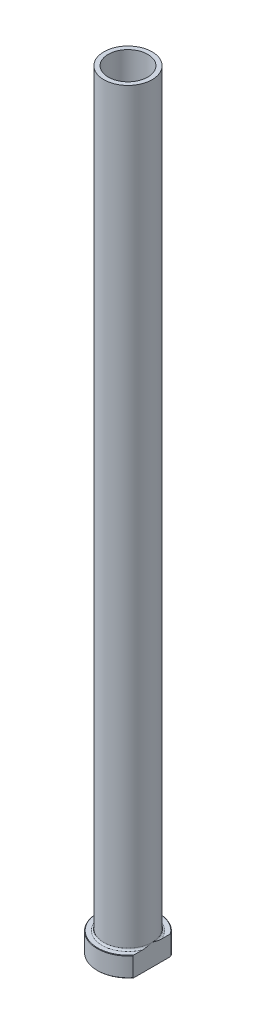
from build123d import *

# Parameters (mm, degrees)
FILLET1_R          = 0.8
CHAMFER1_SIZE      = 0.2
CUT_EXTRUDE1_DEPTH = 351.559552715
CHAMFER2_SIZE      = 0.5


with BuildPart() as part:
    # Sketch1 → Revolve1 (revolve)
    with BuildSketch(Plane.XY, mode=Mode.PRIVATE) as revolve1_sk:
        Polygon((-9, 350), (-11, 350), (-11, 9), (-14, 9), (-14, 0), (-9.25, 0), (-9.25, 283), (-9, 295), align=None)
    revolve(revolve1_sk.sketch.rotate(Axis((0, 92.187680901, 0), (0, -1, 0)), 270), axis=Axis((0, 92.187680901, 0), (0, -1, 0)))

    # Fillet1
    fillet1_edges = [part.edges().sort_by_distance(p)[0] for p in [
        (0, 9, -11),
    ]]
    fillet(fillet1_edges, radius=FILLET1_R)

    # Chamfer1
    chamfer1_edges = [part.edges().sort_by_distance(p)[0] for p in [
        (0, 0, -14),
        (0, 9, -14),
    ]]
    chamfer(chamfer1_edges, length=CHAMFER1_SIZE)

    # Sketch2 → Cut-Extrude1 (cut, through all)
    with BuildSketch(Plane.XZ):
        with BuildLine():
            Line((11, 8.660254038), (11, -8.660254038))
            ThreePointArc((11, -8.660254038), (14, 0), (11, 8.660254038))
        make_face()
    extrude(amount=-CUT_EXTRUDE1_DEPTH, mode=Mode.SUBTRACT)

    # Chamfer2
    chamfer2_edges = [part.edges().sort_by_distance(p)[0] for p in [
        (0, 0, -9.25),
    ]]
    chamfer(chamfer2_edges, length=CHAMFER2_SIZE)


solid = part.part
